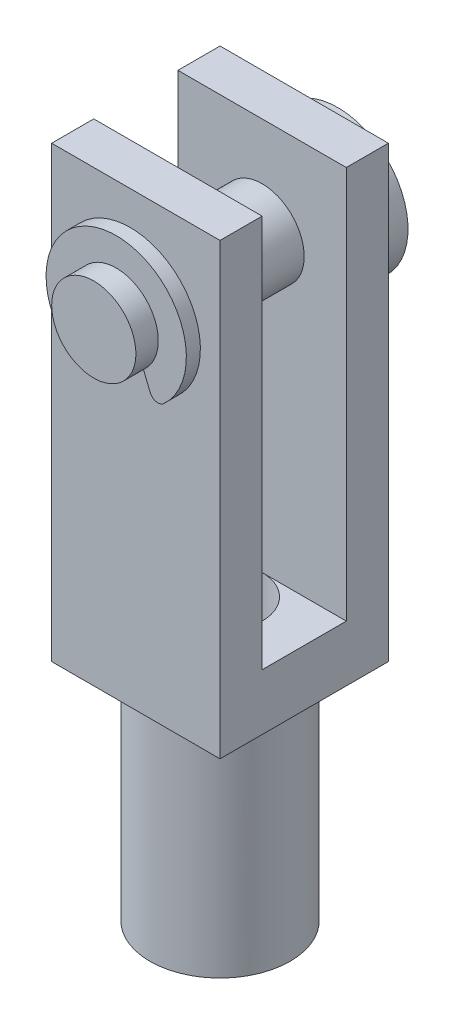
from build123d import *

# Parameters (mm, degrees)
ESQUISSE1_W             = 6
ESQUISSE1_H             = 6
BOSS_EXTRU_1_DEPTH      = 16
ESQUISSE2_R             = 2.5
BOSS_EXTRU_2_DEPTH      = 8
ESQUISSE3_W             = 3
ESQUISSE3_H             = 14
ENL_V_MAT_EXTRU_2_DEPTH = 18.349351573
ESQUISSE4_R             = 1.5
ENL_V_MAT_EXTRU_4_DEPTH = 18.349351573
ENL_V_MAT_EXTRU_5_REACH = 26.372
ESQUISSE5_R             = 1.5
ESQUISSE6_R             = 1.5
BOSS_EXTRU_3_DEPTH      = 7.5
ESQUISSE7_R             = 2.5
BOSS_EXTRU_4_DEPTH      = 1.2
BOSS_EXTRU_5_DEPTH      = 0.5


with BuildPart() as part:
    # Esquisse1 → Boss.-Extru.1 (new body)
    with BuildSketch(Plane(origin=(0, 0, 0), x_dir=(1, 0, 0), z_dir=(0, 1, 0))):
        Rectangle(ESQUISSE1_W, ESQUISSE1_H)
    extrude(amount=BOSS_EXTRU_1_DEPTH)

    # Esquisse2 → Boss.-Extru.2 (add)
    with BuildSketch(Plane(origin=(0, 0, 0), x_dir=(-1, 0, 0), z_dir=(0, -1, 0))):
        with Locations(Location((0, 0, 0), (0, 0, 270))):
            Circle(ESQUISSE2_R)
    extrude(amount=BOSS_EXTRU_2_DEPTH)

    # Esquisse3 → Enl_v. mat.-Extru.2 (cut, through all)
    with BuildSketch(Plane(origin=(3, 0, 0), x_dir=(0, 0, -1), z_dir=(1, 0, 0))):
        with Locations((0, 9)):
            Rectangle(ESQUISSE3_W, ESQUISSE3_H)
    extrude(amount=-ENL_V_MAT_EXTRU_2_DEPTH, mode=Mode.SUBTRACT)

    # Esquisse4 → Enl_v. mat.-Extru.4 (cut, through all)
    with BuildSketch(Plane(origin=(0, 0, -3), x_dir=(-1, 0, 0), z_dir=(0, 0, -1))):
        with Locations((0, 12.5)):
            Circle(ESQUISSE4_R)
    extrude(amount=-ENL_V_MAT_EXTRU_4_DEPTH, mode=Mode.SUBTRACT)

    # Esquisse5 → Enl_v. mat.-Extru.5 (cut, up to next)
    with BuildSketch(Plane.XZ.offset(8), mode=Mode.PRIVATE) as enl_v_mat_extru_5_sk1:
        with Locations(Location((0, 0, 0), (0, 0, 270))):
            Circle(ESQUISSE5_R)
    enl_v_mat_extru_5_tool1 = extrude(enl_v_mat_extru_5_sk1.sketch, amount=-ENL_V_MAT_EXTRU_5_REACH, mode=Mode.PRIVATE) & part.part
    add(enl_v_mat_extru_5_tool1.solids().sort_by_distance((0, -8, 0))[0], mode=Mode.SUBTRACT)


with BuildPart() as body_2:
    # Esquisse6 → Boss.-Extru.3 (new body)
    with BuildSketch(Plane(origin=(0, 0, -3), x_dir=(-1, 0, 0), z_dir=(0, 0, -1))):
        with Locations((0, 12.5)):
            Circle(ESQUISSE6_R)
    extrude(amount=-BOSS_EXTRU_3_DEPTH)

    # Esquisse7 → Boss.-Extru.4 (add)
    with BuildSketch(Plane(origin=(0, 0, -3), x_dir=(-1, 0, 0), z_dir=(0, 0, -1))):
        with Locations((0, 12.5)):
            Circle(ESQUISSE7_R)
    extrude(amount=BOSS_EXTRU_4_DEPTH)


with BuildPart() as body_3:
    # Esquisse8 → Boss.-Extru.5 (new body)
    with BuildSketch(Plane.XY.offset(3.2)):
        with BuildLine():
            Line((-0.869695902, 11.60215311), (-1.208435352, 10.76558429))
            ThreePointArc((-1.208435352, 10.76558429), (-1.42042571, 10.585546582), (-1.689209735, 10.657021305))
            ThreePointArc((-1.689209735, 10.657021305), (0, 15), (1.689209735, 10.657021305))
            ThreePointArc((1.689209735, 10.657021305), (1.42042571, 10.585546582), (1.208435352, 10.76558429))
            Line((1.208435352, 10.76558429), (0.869695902, 11.60215311))
            ThreePointArc((0.869695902, 11.60215311), (0, 13.75), (-0.869695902, 11.60215311))
        make_face()
    extrude(amount=BOSS_EXTRU_5_DEPTH)


solid = Compound([part.part, body_2.part, body_3.part])
